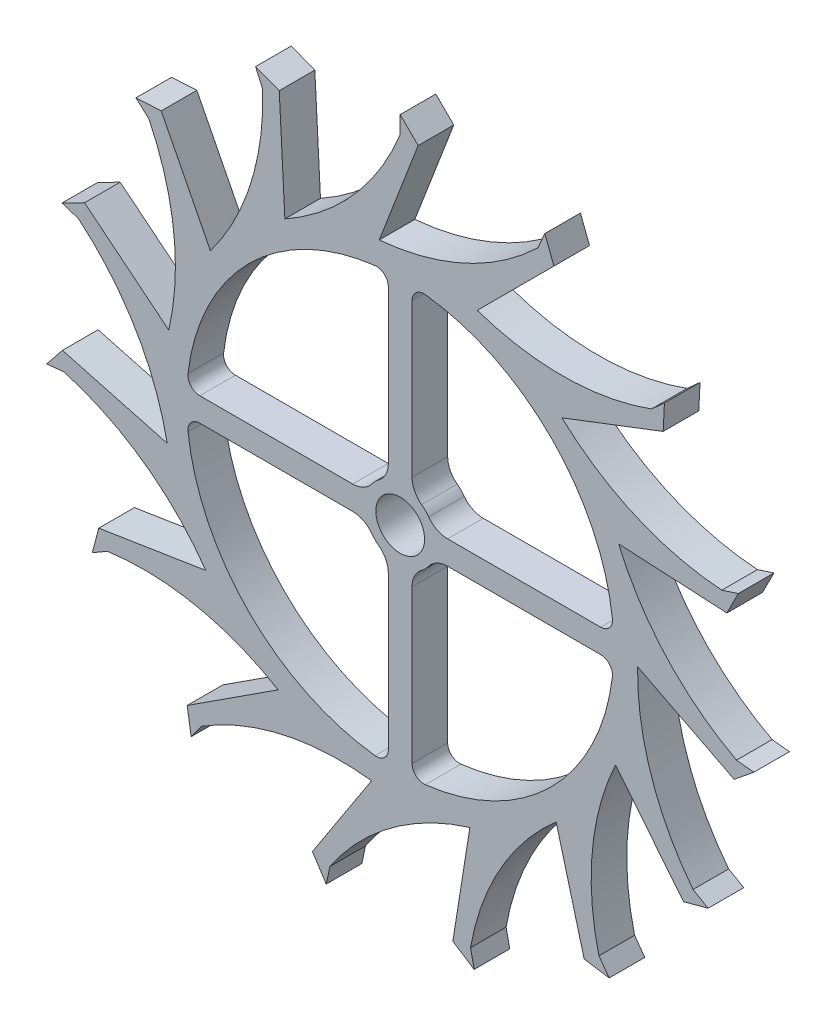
from build123d import *

# Parameters (mm, degrees)
SKETCH1_R           = 15
BOSS_EXTRUDE1_DEPTH = 1.5
CUT_EXTRUDE1_DEPTH  = 1.5
CIRPATTERN1_COUNT   = 15
SKETCH3_R           = 1.026344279
CUT_EXTRUDE2_DEPTH  = 22.174430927


with BuildPart() as part:
    # Sketch1 → Boss-Extrude1 (new body)
    with BuildSketch(Plane.XY):
        Circle(SKETCH1_R)
    extrude(amount=BOSS_EXTRUDE1_DEPTH)

    # Sketch2 → Cut-Extrude1 (cut)
    with BuildSketch(Plane.XY.offset(1.5)):
        with BuildLine():
            Line((-82.03246761, 42.692232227), (-6.123082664, 13.693350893))
            Line((-6.123082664, 13.693350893), (-5.094474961, 13.300402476))
            Line((-5.094474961, 13.300402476), (-4.857757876, 8.740834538))
            ThreePointArc((-4.857757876, 8.740834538), (-1.956320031, 11.074528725), (0, 14.242695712))
            Line((0, 14.242695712), (0, 15))
            Line((0, 15), (0, 96.25989073))
            Line((0, 96.25989073), (-88.858703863, 232.336376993))
            Line((-88.858703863, 232.336376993), (-170.891171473, 178.76871849))
            Line((-170.891171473, 178.76871849), (-82.03246761, 42.692232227))
        make_face()
    cut_extrude1 = extrude(amount=-CUT_EXTRUDE1_DEPTH, mode=Mode.SUBTRACT)

    # CirPattern1: Cut-Extrude1 ×15 about axis
    cirpattern1_axis = Axis((0, 0, 0), (0, 0, 1))
    for i in range(1, CIRPATTERN1_COUNT):
        add(cut_extrude1.rotate(cirpattern1_axis, i * 360 / CIRPATTERN1_COUNT), mode=Mode.SUBTRACT)

    # Sketch3 → Cut-Extrude2 (cut, through all)
    with BuildSketch(Plane.XY.offset(1.5)):
        Circle(SKETCH3_R)
        with BuildLine():
            Line((0.5, 2), (0.5, 8.440971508))
            ThreePointArc((0.5, 8.440971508), (0.667894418, 8.814744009), (1.058823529, 8.937499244))
            ThreePointArc((1.058823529, 8.937499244), (6.363961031, 6.363961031), (8.937499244, 1.058823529))
            ThreePointArc((8.937499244, 1.058823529), (8.814744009, 0.667894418), (8.440971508, 0.5))
            Line((8.440971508, 0.5), (2, 0.5))
            ThreePointArc((2, 0.5), (1.552786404, 0.605572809), (1.2, 0.9))
            ThreePointArc((1.2, 0.9), (1.060660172, 1.060660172), (0.9, 1.2))
            ThreePointArc((0.9, 1.2), (0.605572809, 1.552786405), (0.5, 2))
        make_face()
        with BuildLine():
            Line((-0.5, 2), (-0.5, 8.440971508))
            ThreePointArc((-0.5, 8.440971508), (-0.667894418, 8.814744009), (-1.058823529, 8.937499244))
            ThreePointArc((-1.058823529, 8.937499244), (-6.363961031, 6.363961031), (-8.937499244, 1.058823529))
            ThreePointArc((-8.937499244, 1.058823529), (-8.814744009, 0.667894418), (-8.440971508, 0.5))
            Line((-8.440971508, 0.5), (-2, 0.5))
            ThreePointArc((-2, 0.5), (-1.552786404, 0.605572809), (-1.2, 0.9))
            ThreePointArc((-1.2, 0.9), (-1.060660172, 1.060660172), (-0.9, 1.2))
            ThreePointArc((-0.9, 1.2), (-0.605572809, 1.552786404), (-0.5, 2))
        make_face()
        with BuildLine():
            Line((2, -0.5), (8.440971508, -0.5))
            ThreePointArc((8.440971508, -0.5), (8.814744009, -0.667894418), (8.937499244, -1.058823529))
            ThreePointArc((8.937499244, -1.058823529), (6.363961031, -6.363961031), (1.058823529, -8.937499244))
            ThreePointArc((1.058823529, -8.937499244), (0.667894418, -8.814744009), (0.5, -8.440971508))
            Line((0.5, -8.440971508), (0.5, -2))
            ThreePointArc((0.5, -2), (0.605572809, -1.552786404), (0.9, -1.2))
            ThreePointArc((0.9, -1.2), (1.060660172, -1.060660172), (1.2, -0.9))
            ThreePointArc((1.2, -0.9), (1.552786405, -0.605572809), (2, -0.5))
        make_face()
        with BuildLine():
            Line((-0.5, -2), (-0.5, -8.440971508))
            ThreePointArc((-0.5, -8.440971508), (-0.667894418, -8.814744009), (-1.058823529, -8.937499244))
            ThreePointArc((-1.058823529, -8.937499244), (-6.363961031, -6.363961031), (-8.937499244, -1.058823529))
            ThreePointArc((-8.937499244, -1.058823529), (-8.814744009, -0.667894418), (-8.440971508, -0.5))
            Line((-8.440971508, -0.5), (-2, -0.5))
            ThreePointArc((-2, -0.5), (-1.552786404, -0.605572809), (-1.2, -0.9))
            ThreePointArc((-1.2, -0.9), (-1.060660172, -1.060660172), (-0.9, -1.2))
            ThreePointArc((-0.9, -1.2), (-0.605572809, -1.552786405), (-0.5, -2))
        make_face()
    extrude(amount=-CUT_EXTRUDE2_DEPTH, mode=Mode.SUBTRACT)


solid = part.part
